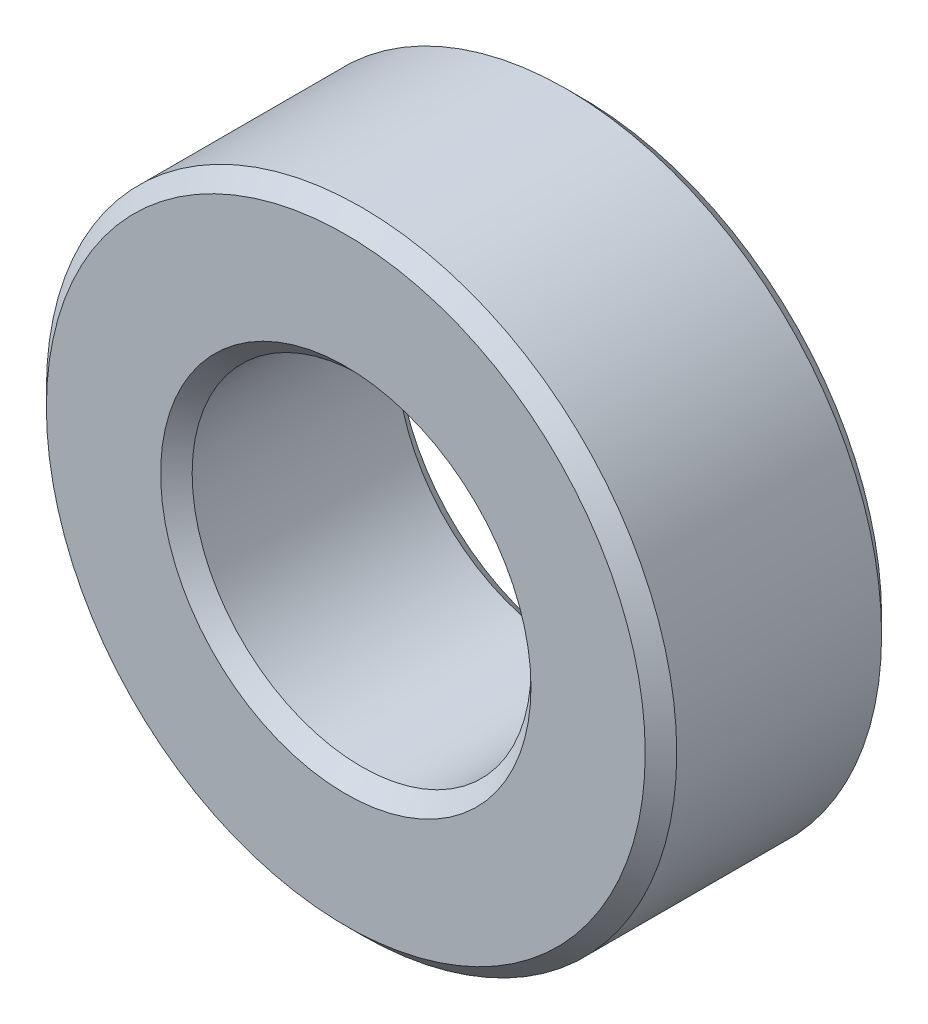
from build123d import *

# Parameters (mm, degrees)
SKETCH1_R           = 4
SKETCH1_R_2         = 2.15
BOSS_EXTRUDE2_DEPTH = 1.5
CHAMFER3_SIZE       = 0.2


with BuildPart() as part:
    # Sketch1 → Boss-Extrude2 (new, symmetric)
    with BuildSketch(Plane.XY):
        Circle(SKETCH1_R)
        Circle(SKETCH1_R_2, mode=Mode.SUBTRACT)
    extrude(amount=BOSS_EXTRUDE2_DEPTH, both=True)

    # Chamfer3
    chamfer3_edges = [part.edges().sort_by_distance(p)[0] for p in [
        (-4, 0, -1.5),
        (-4, 0, 1.5),
        (-2.15, 0, -1.5),
        (-2.15, 0, 1.5),
    ]]
    chamfer(chamfer3_edges, length=CHAMFER3_SIZE)


solid = part.part
